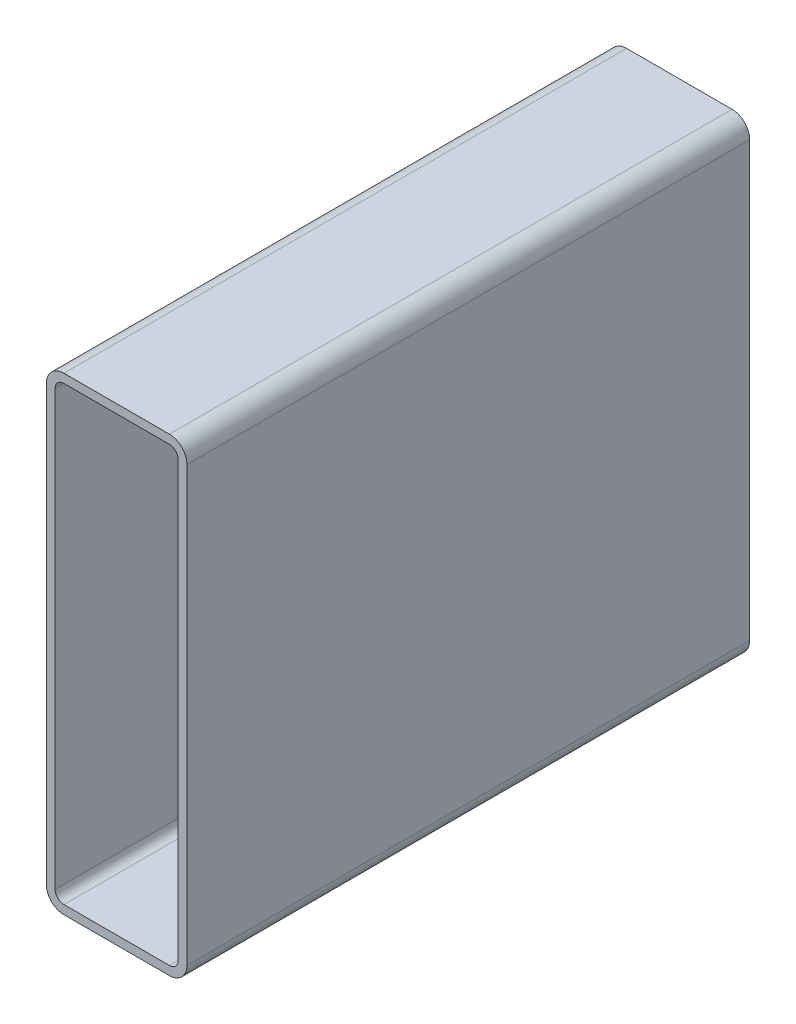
ISO-10303-21;
HEADER;
FILE_DESCRIPTION(('STEP AP214'),'2;1');
FILE_NAME('part.step','',(''),(''),'','','');
FILE_SCHEMA(('AUTOMOTIVE_DESIGN { 1 0 10303 214 1 1 1 1 }'));
ENDSEC;
DATA;
#1=APPLICATION_CONTEXT('core data for automotive mechanical design processes');
#2=APPLICATION_PROTOCOL_DEFINITION('international standard','automotive_design',2000,#1);
#3=PRODUCT_CONTEXT('',#1,'mechanical');
#4=PRODUCT('Part','Part','',(#3));
#5=PRODUCT_RELATED_PRODUCT_CATEGORY('part','',(#4));
#6=PRODUCT_DEFINITION_FORMATION('','',#4);
#7=PRODUCT_DEFINITION_CONTEXT('part definition',#1,'design');
#8=PRODUCT_DEFINITION('design','',#6,#7);
#9=PRODUCT_DEFINITION_SHAPE('','',#8);
#10=(LENGTH_UNIT() NAMED_UNIT(*) SI_UNIT(.MILLI.,.METRE.));
#11=(NAMED_UNIT(*) PLANE_ANGLE_UNIT() SI_UNIT($,.RADIAN.));
#12=(NAMED_UNIT(*) SI_UNIT($,.STERADIAN.) SOLID_ANGLE_UNIT());
#13=UNCERTAINTY_MEASURE_WITH_UNIT(LENGTH_MEASURE(1.E-05),#10,'distance_accuracy_value','');
#14=(GEOMETRIC_REPRESENTATION_CONTEXT(3) GLOBAL_UNCERTAINTY_ASSIGNED_CONTEXT((#13)) GLOBAL_UNIT_ASSIGNED_CONTEXT((#10,
#11,#12)) REPRESENTATION_CONTEXT('',''));
#15=CARTESIAN_POINT('',(0.,0.,0.));
#16=DIRECTION('',(0.,0.,1.));
#17=DIRECTION('',(1.,0.,0.));
#18=AXIS2_PLACEMENT_3D('',#15,#16,#17);
#19=CARTESIAN_POINT('',(12.0141160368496,246.395313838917,304.8));
#20=DIRECTION('',(0.,0.,1.));
#21=DIRECTION('',(1.,0.,0.));
#22=AXIS2_PLACEMENT_3D('',#19,#20,#21);
#23=PLANE('',#22);
#24=CARTESIAN_POINT('',(12.0141160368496,246.395313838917,304.8));
#25=DIRECTION('',(0.,0.,1.));
#26=DIRECTION('',(1.,0.,0.));
#27=AXIS2_PLACEMENT_3D('',#24,#25,#26);
#28=CIRCLE('',#27,9.52500000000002);
#29=CARTESIAN_POINT('',(12.0141160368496,255.920313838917,304.8));
#30=VERTEX_POINT('',#29);
#31=CARTESIAN_POINT('',(2.48911603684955,246.395313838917,304.8));
#32=VERTEX_POINT('',#31);
#33=EDGE_CURVE('E211',#30,#32,#28,.T.);
#34=ORIENTED_EDGE('',*,*,#33,.T.);
#35=DIRECTION('',(0.,-1.,0.));
#36=VECTOR('',#35,1.);
#37=CARTESIAN_POINT('',(2.48911603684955,11.4453138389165,304.8));
#38=LINE('',#37,#36);
#39=CARTESIAN_POINT('',(2.48911603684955,11.4453138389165,304.8));
#40=VERTEX_POINT('',#39);
#41=EDGE_CURVE('E214',#32,#40,#38,.T.);
#42=ORIENTED_EDGE('',*,*,#41,.T.);
#43=CARTESIAN_POINT('',(12.0141160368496,11.4453138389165,304.8));
#44=DIRECTION('',(0.,0.,1.));
#45=DIRECTION('',(1.,0.,0.));
#46=AXIS2_PLACEMENT_3D('',#43,#44,#45);
#47=CIRCLE('',#46,9.525);
#48=CARTESIAN_POINT('',(12.0141160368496,1.92031383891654,304.8));
#49=VERTEX_POINT('',#48);
#50=EDGE_CURVE('E217',#40,#49,#47,.T.);
#51=ORIENTED_EDGE('',*,*,#50,.T.);
#52=DIRECTION('',(1.,0.,0.));
#53=VECTOR('',#52,1.);
#54=CARTESIAN_POINT('',(69.1641160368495,1.92031383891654,304.8));
#55=LINE('',#54,#53);
#56=CARTESIAN_POINT('',(69.1641160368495,1.92031383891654,304.8));
#57=VERTEX_POINT('',#56);
#58=EDGE_CURVE('E219',#49,#57,#55,.T.);
#59=ORIENTED_EDGE('',*,*,#58,.T.);
#60=CARTESIAN_POINT('',(69.1641160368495,11.4453138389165,304.8));
#61=DIRECTION('',(0.,0.,1.));
#62=DIRECTION('',(1.,0.,0.));
#63=AXIS2_PLACEMENT_3D('',#60,#61,#62);
#64=CIRCLE('',#63,9.525);
#65=CARTESIAN_POINT('',(78.6891160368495,11.4453138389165,304.8));
#66=VERTEX_POINT('',#65);
#67=EDGE_CURVE('E221',#57,#66,#64,.T.);
#68=ORIENTED_EDGE('',*,*,#67,.T.);
#69=DIRECTION('',(0.,1.,0.));
#70=VECTOR('',#69,1.);
#71=CARTESIAN_POINT('',(78.6891160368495,246.395313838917,304.8));
#72=LINE('',#71,#70);
#73=CARTESIAN_POINT('',(78.6891160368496,246.395313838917,304.8));
#74=VERTEX_POINT('',#73);
#75=EDGE_CURVE('E223',#66,#74,#72,.T.);
#76=ORIENTED_EDGE('',*,*,#75,.T.);
#77=CARTESIAN_POINT('',(69.1641160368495,246.395313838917,304.8));
#78=DIRECTION('',(0.,0.,1.));
#79=DIRECTION('',(1.,0.,0.));
#80=AXIS2_PLACEMENT_3D('',#77,#78,#79);
#81=CIRCLE('',#80,9.52500000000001);
#82=CARTESIAN_POINT('',(69.1641160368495,255.920313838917,304.8));
#83=VERTEX_POINT('',#82);
#84=EDGE_CURVE('E225',#74,#83,#81,.T.);
#85=ORIENTED_EDGE('',*,*,#84,.T.);
#86=DIRECTION('',(-1.,0.,0.));
#87=VECTOR('',#86,1.);
#88=CARTESIAN_POINT('',(12.0141160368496,255.920313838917,304.8));
#89=LINE('',#88,#87);
#90=EDGE_CURVE('E227',#83,#30,#89,.T.);
#91=ORIENTED_EDGE('',*,*,#90,.T.);
#92=EDGE_LOOP('',(#34,#42,#51,#59,#68,#76,#85,#91));
#93=FACE_BOUND('',#92,.T.);
#94=DIRECTION('',(0.,-1.,0.));
#95=VECTOR('',#94,1.);
#96=CARTESIAN_POINT('',(7.25161603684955,11.4453138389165,304.8));
#97=LINE('',#96,#95);
#98=CARTESIAN_POINT('',(7.25161603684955,246.395313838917,304.8));
#99=VERTEX_POINT('',#98);
#100=CARTESIAN_POINT('',(7.25161603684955,11.4453138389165,304.8));
#101=VERTEX_POINT('',#100);
#102=EDGE_CURVE('E154',#99,#101,#97,.T.);
#103=ORIENTED_EDGE('',*,*,#102,.F.);
#104=CARTESIAN_POINT('',(12.0141160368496,246.395313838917,304.8));
#105=DIRECTION('',(0.,0.,1.));
#106=DIRECTION('',(1.,0.,0.));
#107=AXIS2_PLACEMENT_3D('',#104,#105,#106);
#108=CIRCLE('',#107,4.76250000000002);
#109=CARTESIAN_POINT('',(12.0141160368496,251.157813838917,304.8));
#110=VERTEX_POINT('',#109);
#111=EDGE_CURVE('E146',#110,#99,#108,.T.);
#112=ORIENTED_EDGE('',*,*,#111,.F.);
#113=DIRECTION('',(-1.,0.,0.));
#114=VECTOR('',#113,1.);
#115=CARTESIAN_POINT('',(12.0141160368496,251.157813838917,304.8));
#116=LINE('',#115,#114);
#117=CARTESIAN_POINT('',(69.1641160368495,251.157813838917,304.8));
#118=VERTEX_POINT('',#117);
#119=EDGE_CURVE('E179',#118,#110,#116,.T.);
#120=ORIENTED_EDGE('',*,*,#119,.F.);
#121=CARTESIAN_POINT('',(69.1641160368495,246.395313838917,304.8));
#122=DIRECTION('',(0.,0.,1.));
#123=DIRECTION('',(1.,0.,0.));
#124=AXIS2_PLACEMENT_3D('',#121,#122,#123);
#125=CIRCLE('',#124,4.76250000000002);
#126=CARTESIAN_POINT('',(73.9266160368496,246.395313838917,304.8));
#127=VERTEX_POINT('',#126);
#128=EDGE_CURVE('E177',#127,#118,#125,.T.);
#129=ORIENTED_EDGE('',*,*,#128,.F.);
#130=DIRECTION('',(0.,1.,0.));
#131=VECTOR('',#130,1.);
#132=CARTESIAN_POINT('',(73.9266160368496,246.395313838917,304.8));
#133=LINE('',#132,#131);
#134=CARTESIAN_POINT('',(73.9266160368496,11.4453138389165,304.8));
#135=VERTEX_POINT('',#134);
#136=EDGE_CURVE('E175',#135,#127,#133,.T.);
#137=ORIENTED_EDGE('',*,*,#136,.F.);
#138=CARTESIAN_POINT('',(69.1641160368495,11.4453138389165,304.8));
#139=DIRECTION('',(0.,0.,1.));
#140=DIRECTION('',(1.,0.,0.));
#141=AXIS2_PLACEMENT_3D('',#138,#139,#140);
#142=CIRCLE('',#141,4.7625);
#143=CARTESIAN_POINT('',(69.1641160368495,6.68281383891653,304.8));
#144=VERTEX_POINT('',#143);
#145=EDGE_CURVE('E173',#144,#135,#142,.T.);
#146=ORIENTED_EDGE('',*,*,#145,.F.);
#147=DIRECTION('',(1.,0.,0.));
#148=VECTOR('',#147,1.);
#149=CARTESIAN_POINT('',(69.1641160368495,6.68281383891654,304.8));
#150=LINE('',#149,#148);
#151=CARTESIAN_POINT('',(12.0141160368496,6.68281383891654,304.8));
#152=VERTEX_POINT('',#151);
#153=EDGE_CURVE('E169',#152,#144,#150,.T.);
#154=ORIENTED_EDGE('',*,*,#153,.F.);
#155=CARTESIAN_POINT('',(12.0141160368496,11.4453138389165,304.8));
#156=DIRECTION('',(0.,0.,1.));
#157=DIRECTION('',(1.,0.,0.));
#158=AXIS2_PLACEMENT_3D('',#155,#156,#157);
#159=CIRCLE('',#158,4.7625);
#160=EDGE_CURVE('E167',#101,#152,#159,.T.);
#161=ORIENTED_EDGE('',*,*,#160,.F.);
#162=EDGE_LOOP('',(#103,#112,#120,#129,#137,#146,#154,#161));
#163=FACE_BOUND('',#162,.T.);
#164=ADVANCED_FACE('F33',(#93,#163),#23,.T.);
#165=CARTESIAN_POINT('',(12.0141160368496,246.395313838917,0.));
#166=DIRECTION('',(0.,0.,1.));
#167=DIRECTION('',(1.,0.,0.));
#168=AXIS2_PLACEMENT_3D('',#165,#166,#167);
#169=PLANE('',#168);
#170=CARTESIAN_POINT('',(12.0141160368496,246.395313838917,0.));
#171=DIRECTION('',(0.,0.,1.));
#172=DIRECTION('',(1.,0.,0.));
#173=AXIS2_PLACEMENT_3D('',#170,#171,#172);
#174=CIRCLE('',#173,9.52500000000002);
#175=CARTESIAN_POINT('',(12.0141160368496,255.920313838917,0.));
#176=VERTEX_POINT('',#175);
#177=CARTESIAN_POINT('',(2.48911603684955,246.395313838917,0.));
#178=VERTEX_POINT('',#177);
#179=EDGE_CURVE('E162',#176,#178,#174,.T.);
#180=ORIENTED_EDGE('',*,*,#179,.F.);
#181=DIRECTION('',(-1.,0.,0.));
#182=VECTOR('',#181,1.);
#183=CARTESIAN_POINT('',(12.0141160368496,255.920313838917,0.));
#184=LINE('',#183,#182);
#185=CARTESIAN_POINT('',(69.1641160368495,255.920313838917,0.));
#186=VERTEX_POINT('',#185);
#187=EDGE_CURVE('E215',#186,#176,#184,.T.);
#188=ORIENTED_EDGE('',*,*,#187,.F.);
#189=CARTESIAN_POINT('',(69.1641160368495,246.395313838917,0.));
#190=DIRECTION('',(0.,0.,1.));
#191=DIRECTION('',(1.,0.,0.));
#192=AXIS2_PLACEMENT_3D('',#189,#190,#191);
#193=CIRCLE('',#192,9.52500000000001);
#194=CARTESIAN_POINT('',(78.6891160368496,246.395313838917,0.));
#195=VERTEX_POINT('',#194);
#196=EDGE_CURVE('E242',#195,#186,#193,.T.);
#197=ORIENTED_EDGE('',*,*,#196,.F.);
#198=DIRECTION('',(0.,1.,0.));
#199=VECTOR('',#198,1.);
#200=CARTESIAN_POINT('',(78.6891160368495,246.395313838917,0.));
#201=LINE('',#200,#199);
#202=CARTESIAN_POINT('',(78.6891160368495,11.4453138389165,0.));
#203=VERTEX_POINT('',#202);
#204=EDGE_CURVE('E240',#203,#195,#201,.T.);
#205=ORIENTED_EDGE('',*,*,#204,.F.);
#206=CARTESIAN_POINT('',(69.1641160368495,11.4453138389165,0.));
#207=DIRECTION('',(0.,0.,1.));
#208=DIRECTION('',(1.,0.,0.));
#209=AXIS2_PLACEMENT_3D('',#206,#207,#208);
#210=CIRCLE('',#209,9.525);
#211=CARTESIAN_POINT('',(69.1641160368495,1.92031383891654,0.));
#212=VERTEX_POINT('',#211);
#213=EDGE_CURVE('E238',#212,#203,#210,.T.);
#214=ORIENTED_EDGE('',*,*,#213,.F.);
#215=DIRECTION('',(1.,0.,0.));
#216=VECTOR('',#215,1.);
#217=CARTESIAN_POINT('',(69.1641160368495,1.92031383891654,0.));
#218=LINE('',#217,#216);
#219=CARTESIAN_POINT('',(12.0141160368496,1.92031383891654,0.));
#220=VERTEX_POINT('',#219);
#221=EDGE_CURVE('E236',#220,#212,#218,.T.);
#222=ORIENTED_EDGE('',*,*,#221,.F.);
#223=CARTESIAN_POINT('',(12.0141160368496,11.4453138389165,0.));
#224=DIRECTION('',(0.,0.,1.));
#225=DIRECTION('',(1.,0.,0.));
#226=AXIS2_PLACEMENT_3D('',#223,#224,#225);
#227=CIRCLE('',#226,9.525);
#228=CARTESIAN_POINT('',(2.48911603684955,11.4453138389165,0.));
#229=VERTEX_POINT('',#228);
#230=EDGE_CURVE('E234',#229,#220,#227,.T.);
#231=ORIENTED_EDGE('',*,*,#230,.F.);
#232=DIRECTION('',(0.,-1.,0.));
#233=VECTOR('',#232,1.);
#234=CARTESIAN_POINT('',(2.48911603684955,11.4453138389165,0.));
#235=LINE('',#234,#233);
#236=EDGE_CURVE('E232',#178,#229,#235,.T.);
#237=ORIENTED_EDGE('',*,*,#236,.F.);
#238=EDGE_LOOP('',(#180,#188,#197,#205,#214,#222,#231,#237));
#239=FACE_BOUND('',#238,.T.);
#240=CARTESIAN_POINT('',(12.0141160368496,246.395313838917,0.));
#241=DIRECTION('',(0.,0.,1.));
#242=DIRECTION('',(1.,0.,0.));
#243=AXIS2_PLACEMENT_3D('',#240,#241,#242);
#244=CIRCLE('',#243,4.76250000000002);
#245=CARTESIAN_POINT('',(12.0141160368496,251.157813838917,0.));
#246=VERTEX_POINT('',#245);
#247=CARTESIAN_POINT('',(7.25161603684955,246.395313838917,0.));
#248=VERTEX_POINT('',#247);
#249=EDGE_CURVE('E56',#246,#248,#244,.T.);
#250=ORIENTED_EDGE('',*,*,#249,.T.);
#251=DIRECTION('',(0.,-1.,0.));
#252=VECTOR('',#251,1.);
#253=CARTESIAN_POINT('',(7.25161603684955,11.4453138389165,0.));
#254=LINE('',#253,#252);
#255=CARTESIAN_POINT('',(7.25161603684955,11.4453138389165,0.));
#256=VERTEX_POINT('',#255);
#257=EDGE_CURVE('E161',#248,#256,#254,.T.);
#258=ORIENTED_EDGE('',*,*,#257,.T.);
#259=CARTESIAN_POINT('',(12.0141160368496,11.4453138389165,0.));
#260=DIRECTION('',(0.,0.,1.));
#261=DIRECTION('',(1.,0.,0.));
#262=AXIS2_PLACEMENT_3D('',#259,#260,#261);
#263=CIRCLE('',#262,4.7625);
#264=CARTESIAN_POINT('',(12.0141160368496,6.68281383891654,0.));
#265=VERTEX_POINT('',#264);
#266=EDGE_CURVE('E183',#256,#265,#263,.T.);
#267=ORIENTED_EDGE('',*,*,#266,.T.);
#268=DIRECTION('',(1.,0.,0.));
#269=VECTOR('',#268,1.);
#270=CARTESIAN_POINT('',(69.1641160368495,6.68281383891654,0.));
#271=LINE('',#270,#269);
#272=CARTESIAN_POINT('',(69.1641160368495,6.68281383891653,0.));
#273=VERTEX_POINT('',#272);
#274=EDGE_CURVE('E186',#265,#273,#271,.T.);
#275=ORIENTED_EDGE('',*,*,#274,.T.);
#276=CARTESIAN_POINT('',(69.1641160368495,11.4453138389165,0.));
#277=DIRECTION('',(0.,0.,1.));
#278=DIRECTION('',(1.,0.,0.));
#279=AXIS2_PLACEMENT_3D('',#276,#277,#278);
#280=CIRCLE('',#279,4.7625);
#281=CARTESIAN_POINT('',(73.9266160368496,11.4453138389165,0.));
#282=VERTEX_POINT('',#281);
#283=EDGE_CURVE('E189',#273,#282,#280,.T.);
#284=ORIENTED_EDGE('',*,*,#283,.T.);
#285=DIRECTION('',(0.,1.,0.));
#286=VECTOR('',#285,1.);
#287=CARTESIAN_POINT('',(73.9266160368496,246.395313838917,0.));
#288=LINE('',#287,#286);
#289=CARTESIAN_POINT('',(73.9266160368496,246.395313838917,0.));
#290=VERTEX_POINT('',#289);
#291=EDGE_CURVE('E192',#282,#290,#288,.T.);
#292=ORIENTED_EDGE('',*,*,#291,.T.);
#293=CARTESIAN_POINT('',(69.1641160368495,246.395313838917,0.));
#294=DIRECTION('',(0.,0.,1.));
#295=DIRECTION('',(1.,0.,0.));
#296=AXIS2_PLACEMENT_3D('',#293,#294,#295);
#297=CIRCLE('',#296,4.76250000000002);
#298=CARTESIAN_POINT('',(69.1641160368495,251.157813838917,0.));
#299=VERTEX_POINT('',#298);
#300=EDGE_CURVE('E195',#290,#299,#297,.T.);
#301=ORIENTED_EDGE('',*,*,#300,.T.);
#302=DIRECTION('',(-1.,0.,0.));
#303=VECTOR('',#302,1.);
#304=CARTESIAN_POINT('',(12.0141160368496,251.157813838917,0.));
#305=LINE('',#304,#303);
#306=EDGE_CURVE('E155',#299,#246,#305,.T.);
#307=ORIENTED_EDGE('',*,*,#306,.T.);
#308=EDGE_LOOP('',(#250,#258,#267,#275,#284,#292,#301,#307));
#309=FACE_BOUND('',#308,.T.);
#310=ADVANCED_FACE('F272',(#239,#309),#169,.F.);
#311=CARTESIAN_POINT('',(12.0141160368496,246.395313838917,304.8));
#312=DIRECTION('',(0.,0.,-1.));
#313=DIRECTION('',(-1.,0.,0.));
#314=AXIS2_PLACEMENT_3D('',#311,#312,#313);
#315=CYLINDRICAL_SURFACE('',#314,9.52500000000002);
#316=ORIENTED_EDGE('',*,*,#179,.T.);
#317=DIRECTION('',(0.,0.,-1.));
#318=VECTOR('',#317,1.);
#319=CARTESIAN_POINT('',(2.48911603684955,246.395313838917,304.8));
#320=LINE('',#319,#318);
#321=EDGE_CURVE('E11',#32,#178,#320,.T.);
#322=ORIENTED_EDGE('',*,*,#321,.F.);
#323=ORIENTED_EDGE('',*,*,#33,.F.);
#324=DIRECTION('',(0.,0.,-1.));
#325=VECTOR('',#324,1.);
#326=CARTESIAN_POINT('',(12.0141160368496,255.920313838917,304.8));
#327=LINE('',#326,#325);
#328=EDGE_CURVE('E229',#30,#176,#327,.T.);
#329=ORIENTED_EDGE('',*,*,#328,.T.);
#330=EDGE_LOOP('',(#316,#322,#323,#329));
#331=FACE_BOUND('',#330,.T.);
#332=ADVANCED_FACE('F35',(#331),#315,.T.);
#333=CARTESIAN_POINT('',(2.48911603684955,11.4453138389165,304.8));
#334=DIRECTION('',(1.,0.,0.));
#335=DIRECTION('',(0.,0.,-1.));
#336=AXIS2_PLACEMENT_3D('',#333,#334,#335);
#337=PLANE('',#336);
#338=ORIENTED_EDGE('',*,*,#236,.T.);
#339=DIRECTION('',(0.,0.,-1.));
#340=VECTOR('',#339,1.);
#341=CARTESIAN_POINT('',(2.48911603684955,11.4453138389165,304.8));
#342=LINE('',#341,#340);
#343=EDGE_CURVE('E41',#40,#229,#342,.T.);
#344=ORIENTED_EDGE('',*,*,#343,.F.);
#345=ORIENTED_EDGE('',*,*,#41,.F.);
#346=ORIENTED_EDGE('',*,*,#321,.T.);
#347=EDGE_LOOP('',(#338,#344,#345,#346));
#348=FACE_BOUND('',#347,.T.);
#349=ADVANCED_FACE('F289',(#348),#337,.F.);
#350=CARTESIAN_POINT('',(12.0141160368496,11.4453138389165,304.8));
#351=DIRECTION('',(0.,0.,-1.));
#352=DIRECTION('',(-1.,0.,0.));
#353=AXIS2_PLACEMENT_3D('',#350,#351,#352);
#354=CYLINDRICAL_SURFACE('',#353,9.525);
#355=ORIENTED_EDGE('',*,*,#230,.T.);
#356=DIRECTION('',(0.,0.,-1.));
#357=VECTOR('',#356,1.);
#358=CARTESIAN_POINT('',(12.0141160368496,1.92031383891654,304.8));
#359=LINE('',#358,#357);
#360=EDGE_CURVE('E259',#49,#220,#359,.T.);
#361=ORIENTED_EDGE('',*,*,#360,.F.);
#362=ORIENTED_EDGE('',*,*,#50,.F.);
#363=ORIENTED_EDGE('',*,*,#343,.T.);
#364=EDGE_LOOP('',(#355,#361,#362,#363));
#365=FACE_BOUND('',#364,.T.);
#366=ADVANCED_FACE('F266',(#365),#354,.T.);
#367=CARTESIAN_POINT('',(69.1641160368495,1.92031383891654,304.8));
#368=DIRECTION('',(0.,1.,0.));
#369=DIRECTION('',(0.,0.,1.));
#370=AXIS2_PLACEMENT_3D('',#367,#368,#369);
#371=PLANE('',#370);
#372=ORIENTED_EDGE('',*,*,#221,.T.);
#373=DIRECTION('',(0.,0.,-1.));
#374=VECTOR('',#373,1.);
#375=CARTESIAN_POINT('',(69.1641160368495,1.92031383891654,304.8));
#376=LINE('',#375,#374);
#377=EDGE_CURVE('E256',#57,#212,#376,.T.);
#378=ORIENTED_EDGE('',*,*,#377,.F.);
#379=ORIENTED_EDGE('',*,*,#58,.F.);
#380=ORIENTED_EDGE('',*,*,#360,.T.);
#381=EDGE_LOOP('',(#372,#378,#379,#380));
#382=FACE_BOUND('',#381,.T.);
#383=ADVANCED_FACE('F278',(#382),#371,.F.);
#384=CARTESIAN_POINT('',(69.1641160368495,11.4453138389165,304.8));
#385=DIRECTION('',(0.,0.,-1.));
#386=DIRECTION('',(-1.,0.,0.));
#387=AXIS2_PLACEMENT_3D('',#384,#385,#386);
#388=CYLINDRICAL_SURFACE('',#387,9.525);
#389=ORIENTED_EDGE('',*,*,#213,.T.);
#390=DIRECTION('',(0.,0.,-1.));
#391=VECTOR('',#390,1.);
#392=CARTESIAN_POINT('',(78.6891160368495,11.4453138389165,304.8));
#393=LINE('',#392,#391);
#394=EDGE_CURVE('E253',#66,#203,#393,.T.);
#395=ORIENTED_EDGE('',*,*,#394,.F.);
#396=ORIENTED_EDGE('',*,*,#67,.F.);
#397=ORIENTED_EDGE('',*,*,#377,.T.);
#398=EDGE_LOOP('',(#389,#395,#396,#397));
#399=FACE_BOUND('',#398,.T.);
#400=ADVANCED_FACE('F282',(#399),#388,.T.);
#401=CARTESIAN_POINT('',(78.6891160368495,246.395313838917,304.8));
#402=DIRECTION('',(-1.,0.,0.));
#403=DIRECTION('',(0.,0.,1.));
#404=AXIS2_PLACEMENT_3D('',#401,#402,#403);
#405=PLANE('',#404);
#406=ORIENTED_EDGE('',*,*,#204,.T.);
#407=DIRECTION('',(0.,0.,-1.));
#408=VECTOR('',#407,1.);
#409=CARTESIAN_POINT('',(78.6891160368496,246.395313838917,304.8));
#410=LINE('',#409,#408);
#411=EDGE_CURVE('E250',#74,#195,#410,.T.);
#412=ORIENTED_EDGE('',*,*,#411,.F.);
#413=ORIENTED_EDGE('',*,*,#75,.F.);
#414=ORIENTED_EDGE('',*,*,#394,.T.);
#415=EDGE_LOOP('',(#406,#412,#413,#414));
#416=FACE_BOUND('',#415,.T.);
#417=ADVANCED_FACE('F302',(#416),#405,.F.);
#418=CARTESIAN_POINT('',(69.1641160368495,246.395313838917,304.8));
#419=DIRECTION('',(0.,0.,-1.));
#420=DIRECTION('',(-1.,0.,0.));
#421=AXIS2_PLACEMENT_3D('',#418,#419,#420);
#422=CYLINDRICAL_SURFACE('',#421,9.52500000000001);
#423=ORIENTED_EDGE('',*,*,#196,.T.);
#424=DIRECTION('',(0.,0.,-1.));
#425=VECTOR('',#424,1.);
#426=CARTESIAN_POINT('',(69.1641160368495,255.920313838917,304.8));
#427=LINE('',#426,#425);
#428=EDGE_CURVE('E247',#83,#186,#427,.T.);
#429=ORIENTED_EDGE('',*,*,#428,.F.);
#430=ORIENTED_EDGE('',*,*,#84,.F.);
#431=ORIENTED_EDGE('',*,*,#411,.T.);
#432=EDGE_LOOP('',(#423,#429,#430,#431));
#433=FACE_BOUND('',#432,.T.);
#434=ADVANCED_FACE('F300',(#433),#422,.T.);
#435=CARTESIAN_POINT('',(12.0141160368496,255.920313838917,304.8));
#436=DIRECTION('',(0.,-1.,0.));
#437=DIRECTION('',(0.,0.,-1.));
#438=AXIS2_PLACEMENT_3D('',#435,#436,#437);
#439=PLANE('',#438);
#440=ORIENTED_EDGE('',*,*,#187,.T.);
#441=ORIENTED_EDGE('',*,*,#328,.F.);
#442=ORIENTED_EDGE('',*,*,#90,.F.);
#443=ORIENTED_EDGE('',*,*,#428,.T.);
#444=EDGE_LOOP('',(#440,#441,#442,#443));
#445=FACE_BOUND('',#444,.T.);
#446=ADVANCED_FACE('F295',(#445),#439,.F.);
#447=CARTESIAN_POINT('',(12.0141160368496,246.395313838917,304.8));
#448=DIRECTION('',(0.,0.,-1.));
#449=DIRECTION('',(-1.,0.,0.));
#450=AXIS2_PLACEMENT_3D('',#447,#448,#449);
#451=CYLINDRICAL_SURFACE('',#450,4.76250000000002);
#452=ORIENTED_EDGE('',*,*,#249,.F.);
#453=DIRECTION('',(0.,0.,-1.));
#454=VECTOR('',#453,1.);
#455=CARTESIAN_POINT('',(12.0141160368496,251.157813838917,304.8));
#456=LINE('',#455,#454);
#457=EDGE_CURVE('E150',#110,#246,#456,.T.);
#458=ORIENTED_EDGE('',*,*,#457,.F.);
#459=ORIENTED_EDGE('',*,*,#111,.T.);
#460=DIRECTION('',(0.,0.,-1.));
#461=VECTOR('',#460,1.);
#462=CARTESIAN_POINT('',(7.25161603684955,246.395313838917,304.8));
#463=LINE('',#462,#461);
#464=EDGE_CURVE('E149',#99,#248,#463,.T.);
#465=ORIENTED_EDGE('',*,*,#464,.T.);
#466=EDGE_LOOP('',(#452,#458,#459,#465));
#467=FACE_BOUND('',#466,.T.);
#468=ADVANCED_FACE('F148',(#467),#451,.F.);
#469=CARTESIAN_POINT('',(7.25161603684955,11.4453138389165,304.8));
#470=DIRECTION('',(1.,0.,0.));
#471=DIRECTION('',(0.,0.,-1.));
#472=AXIS2_PLACEMENT_3D('',#469,#470,#471);
#473=PLANE('',#472);
#474=ORIENTED_EDGE('',*,*,#257,.F.);
#475=ORIENTED_EDGE('',*,*,#464,.F.);
#476=ORIENTED_EDGE('',*,*,#102,.T.);
#477=DIRECTION('',(0.,0.,-1.));
#478=VECTOR('',#477,1.);
#479=CARTESIAN_POINT('',(7.25161603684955,11.4453138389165,304.8));
#480=LINE('',#479,#478);
#481=EDGE_CURVE('E163',#101,#256,#480,.T.);
#482=ORIENTED_EDGE('',*,*,#481,.T.);
#483=EDGE_LOOP('',(#474,#475,#476,#482));
#484=FACE_BOUND('',#483,.T.);
#485=ADVANCED_FACE('F158',(#484),#473,.T.);
#486=CARTESIAN_POINT('',(12.0141160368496,11.4453138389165,304.8));
#487=DIRECTION('',(0.,0.,-1.));
#488=DIRECTION('',(-1.,0.,0.));
#489=AXIS2_PLACEMENT_3D('',#486,#487,#488);
#490=CYLINDRICAL_SURFACE('',#489,4.7625);
#491=ORIENTED_EDGE('',*,*,#266,.F.);
#492=ORIENTED_EDGE('',*,*,#481,.F.);
#493=ORIENTED_EDGE('',*,*,#160,.T.);
#494=DIRECTION('',(0.,0.,-1.));
#495=VECTOR('',#494,1.);
#496=CARTESIAN_POINT('',(12.0141160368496,6.68281383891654,304.8));
#497=LINE('',#496,#495);
#498=EDGE_CURVE('E208',#152,#265,#497,.T.);
#499=ORIENTED_EDGE('',*,*,#498,.T.);
#500=EDGE_LOOP('',(#491,#492,#493,#499));
#501=FACE_BOUND('',#500,.T.);
#502=ADVANCED_FACE('F327',(#501),#490,.F.);
#503=CARTESIAN_POINT('',(69.1641160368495,6.68281383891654,304.8));
#504=DIRECTION('',(0.,1.,0.));
#505=DIRECTION('',(0.,0.,1.));
#506=AXIS2_PLACEMENT_3D('',#503,#504,#505);
#507=PLANE('',#506);
#508=ORIENTED_EDGE('',*,*,#274,.F.);
#509=ORIENTED_EDGE('',*,*,#498,.F.);
#510=ORIENTED_EDGE('',*,*,#153,.T.);
#511=DIRECTION('',(0.,0.,-1.));
#512=VECTOR('',#511,1.);
#513=CARTESIAN_POINT('',(69.1641160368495,6.68281383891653,304.8));
#514=LINE('',#513,#512);
#515=EDGE_CURVE('E206',#144,#273,#514,.T.);
#516=ORIENTED_EDGE('',*,*,#515,.T.);
#517=EDGE_LOOP('',(#508,#509,#510,#516));
#518=FACE_BOUND('',#517,.T.);
#519=ADVANCED_FACE('F331',(#518),#507,.T.);
#520=CARTESIAN_POINT('',(69.1641160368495,11.4453138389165,304.8));
#521=DIRECTION('',(0.,0.,-1.));
#522=DIRECTION('',(-1.,0.,0.));
#523=AXIS2_PLACEMENT_3D('',#520,#521,#522);
#524=CYLINDRICAL_SURFACE('',#523,4.7625);
#525=ORIENTED_EDGE('',*,*,#283,.F.);
#526=ORIENTED_EDGE('',*,*,#515,.F.);
#527=ORIENTED_EDGE('',*,*,#145,.T.);
#528=DIRECTION('',(0.,0.,-1.));
#529=VECTOR('',#528,1.);
#530=CARTESIAN_POINT('',(73.9266160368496,11.4453138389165,304.8));
#531=LINE('',#530,#529);
#532=EDGE_CURVE('E204',#135,#282,#531,.T.);
#533=ORIENTED_EDGE('',*,*,#532,.T.);
#534=EDGE_LOOP('',(#525,#526,#527,#533));
#535=FACE_BOUND('',#534,.T.);
#536=ADVANCED_FACE('F337',(#535),#524,.F.);
#537=CARTESIAN_POINT('',(73.9266160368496,246.395313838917,304.8));
#538=DIRECTION('',(-1.,0.,0.));
#539=DIRECTION('',(0.,0.,1.));
#540=AXIS2_PLACEMENT_3D('',#537,#538,#539);
#541=PLANE('',#540);
#542=ORIENTED_EDGE('',*,*,#291,.F.);
#543=ORIENTED_EDGE('',*,*,#532,.F.);
#544=ORIENTED_EDGE('',*,*,#136,.T.);
#545=DIRECTION('',(0.,0.,-1.));
#546=VECTOR('',#545,1.);
#547=CARTESIAN_POINT('',(73.9266160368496,246.395313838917,304.8));
#548=LINE('',#547,#546);
#549=EDGE_CURVE('E202',#127,#290,#548,.T.);
#550=ORIENTED_EDGE('',*,*,#549,.T.);
#551=EDGE_LOOP('',(#542,#543,#544,#550));
#552=FACE_BOUND('',#551,.T.);
#553=ADVANCED_FACE('F341',(#552),#541,.T.);
#554=CARTESIAN_POINT('',(69.1641160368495,246.395313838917,304.8));
#555=DIRECTION('',(0.,0.,-1.));
#556=DIRECTION('',(-1.,0.,0.));
#557=AXIS2_PLACEMENT_3D('',#554,#555,#556);
#558=CYLINDRICAL_SURFACE('',#557,4.76250000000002);
#559=ORIENTED_EDGE('',*,*,#300,.F.);
#560=ORIENTED_EDGE('',*,*,#549,.F.);
#561=ORIENTED_EDGE('',*,*,#128,.T.);
#562=DIRECTION('',(0.,0.,-1.));
#563=VECTOR('',#562,1.);
#564=CARTESIAN_POINT('',(69.1641160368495,251.157813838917,304.8));
#565=LINE('',#564,#563);
#566=EDGE_CURVE('E48',#118,#299,#565,.T.);
#567=ORIENTED_EDGE('',*,*,#566,.T.);
#568=EDGE_LOOP('',(#559,#560,#561,#567));
#569=FACE_BOUND('',#568,.T.);
#570=ADVANCED_FACE('F345',(#569),#558,.F.);
#571=CARTESIAN_POINT('',(12.0141160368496,251.157813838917,304.8));
#572=DIRECTION('',(0.,-1.,0.));
#573=DIRECTION('',(0.,0.,-1.));
#574=AXIS2_PLACEMENT_3D('',#571,#572,#573);
#575=PLANE('',#574);
#576=ORIENTED_EDGE('',*,*,#306,.F.);
#577=ORIENTED_EDGE('',*,*,#566,.F.);
#578=ORIENTED_EDGE('',*,*,#119,.T.);
#579=ORIENTED_EDGE('',*,*,#457,.T.);
#580=EDGE_LOOP('',(#576,#577,#578,#579));
#581=FACE_BOUND('',#580,.T.);
#582=ADVANCED_FACE('F349',(#581),#575,.T.);
#583=CLOSED_SHELL('',(#164,#310,#332,#349,#366,#383,#400,#417,#434,#446,#468,#485,#502,#519,
#536,#553,#570,#582));
#584=MANIFOLD_SOLID_BREP('B2',#583);
#585=ADVANCED_BREP_SHAPE_REPRESENTATION('',(#18,#584),#14);
#586=SHAPE_DEFINITION_REPRESENTATION(#9,#585);
ENDSEC;
END-ISO-10303-21;
